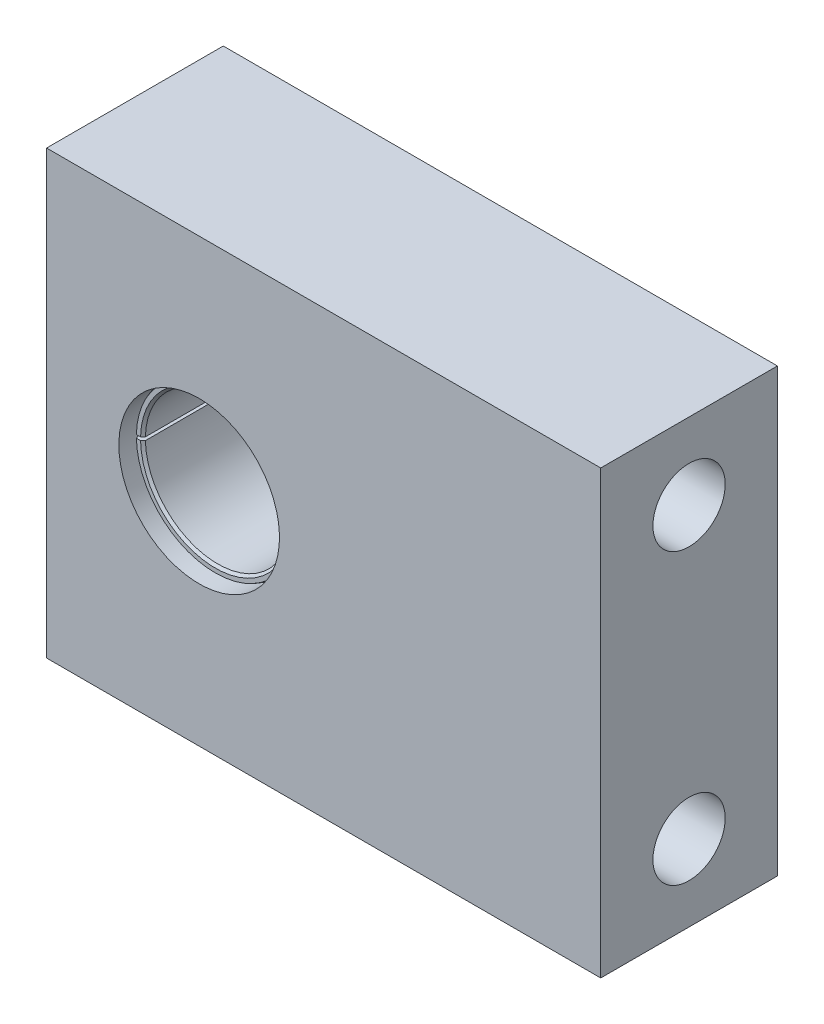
ISO-10303-21;
HEADER;
FILE_DESCRIPTION(('STEP AP214'),'2;1');
FILE_NAME('part.step','',(''),(''),'','','');
FILE_SCHEMA(('AUTOMOTIVE_DESIGN { 1 0 10303 214 1 1 1 1 }'));
ENDSEC;
DATA;
#1=APPLICATION_CONTEXT('core data for automotive mechanical design processes');
#2=APPLICATION_PROTOCOL_DEFINITION('international standard','automotive_design',2000,#1);
#3=PRODUCT_CONTEXT('',#1,'mechanical');
#4=PRODUCT('Part','Part','',(#3));
#5=PRODUCT_RELATED_PRODUCT_CATEGORY('part','',(#4));
#6=PRODUCT_DEFINITION_FORMATION('','',#4);
#7=PRODUCT_DEFINITION_CONTEXT('part definition',#1,'design');
#8=PRODUCT_DEFINITION('design','',#6,#7);
#9=PRODUCT_DEFINITION_SHAPE('','',#8);
#10=(LENGTH_UNIT() NAMED_UNIT(*) SI_UNIT(.MILLI.,.METRE.));
#11=(NAMED_UNIT(*) PLANE_ANGLE_UNIT() SI_UNIT($,.RADIAN.));
#12=(NAMED_UNIT(*) SI_UNIT($,.STERADIAN.) SOLID_ANGLE_UNIT());
#13=UNCERTAINTY_MEASURE_WITH_UNIT(LENGTH_MEASURE(1.E-05),#10,'distance_accuracy_value','');
#14=(GEOMETRIC_REPRESENTATION_CONTEXT(3) GLOBAL_UNCERTAINTY_ASSIGNED_CONTEXT((#13)) GLOBAL_UNIT_ASSIGNED_CONTEXT((#10,
#11,#12)) REPRESENTATION_CONTEXT('',''));
#15=CARTESIAN_POINT('',(0.,0.,0.));
#16=DIRECTION('',(0.,0.,1.));
#17=DIRECTION('',(1.,0.,0.));
#18=AXIS2_PLACEMENT_3D('',#15,#16,#17);
#19=CARTESIAN_POINT('',(-60.346410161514,18.2,9.));
#20=DIRECTION('',(0.,1.,0.));
#21=DIRECTION('',(0.,0.,-1.));
#22=AXIS2_PLACEMENT_3D('',#19,#20,#21);
#23=PLANE('',#22);
#24=DIRECTION('',(1.,0.,0.));
#25=VECTOR('',#24,1.);
#26=CARTESIAN_POINT('',(-60.346410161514,18.2,-11.));
#27=LINE('',#26,#25);
#28=CARTESIAN_POINT('',(-60.346410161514,18.2,-11.));
#29=VERTEX_POINT('',#28);
#30=CARTESIAN_POINT('',(-59.99799979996,18.2,-11.));
#31=VERTEX_POINT('',#30);
#32=EDGE_CURVE('E9',#29,#31,#27,.T.);
#33=ORIENTED_EDGE('',*,*,#32,.F.);
#34=DIRECTION('',(0.,0.,-1.));
#35=VECTOR('',#34,1.);
#36=CARTESIAN_POINT('',(-60.346410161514,18.2,9.));
#37=LINE('',#36,#35);
#38=CARTESIAN_POINT('',(-60.346410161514,18.2,-12.));
#39=VERTEX_POINT('',#38);
#40=EDGE_CURVE('E140',#29,#39,#37,.T.);
#41=ORIENTED_EDGE('',*,*,#40,.T.);
#42=DIRECTION('',(1.,0.,0.));
#43=VECTOR('',#42,1.);
#44=CARTESIAN_POINT('',(-60.346410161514,18.2,-12.));
#45=LINE('',#44,#43);
#46=CARTESIAN_POINT('',(-59.4978945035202,18.2,-12.));
#47=VERTEX_POINT('',#46);
#48=EDGE_CURVE('E345',#39,#47,#45,.T.);
#49=ORIENTED_EDGE('',*,*,#48,.T.);
#50=CARTESIAN_POINT('',(-59.4978945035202,18.1999999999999,-12.));
#51=CARTESIAN_POINT('',(-59.4447247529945,18.1999999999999,-12.));
#52=CARTESIAN_POINT('',(-59.3908863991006,18.1999999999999,-11.9913046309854));
#53=CARTESIAN_POINT('',(-59.2872805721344,18.1999999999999,-11.9569409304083));
#54=CARTESIAN_POINT('',(-59.2364510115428,18.1999999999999,-11.9298976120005));
#55=CARTESIAN_POINT('',(-59.1643973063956,18.1999999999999,-11.8742450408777));
#56=CARTESIAN_POINT('',(-59.1387783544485,18.1999999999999,-11.8497481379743));
#57=CARTESIAN_POINT('',(-59.0799770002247,18.1999999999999,-11.7802791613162));
#58=CARTESIAN_POINT('',(-59.0506993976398,18.1999999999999,-11.7307389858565));
#59=CARTESIAN_POINT('',(-59.0107444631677,18.1999999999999,-11.6262008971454));
#60=CARTESIAN_POINT('',(-58.9995164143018,18.1999999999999,-11.5697612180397));
#61=CARTESIAN_POINT('',(-58.9978427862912,18.1999999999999,-11.5092736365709));
#62=CARTESIAN_POINT('',(-58.9977775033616,18.1999999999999,-11.5045538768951));
#63=CARTESIAN_POINT('',(-58.9977775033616,18.1999999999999,-11.5));
#64=B_SPLINE_CURVE_WITH_KNOTS('',3,(#50,#51,#52,#53,#54,#55,#56,#57,#58,#59,#60,#61,#62,#63),
.UNSPECIFIED.,.F.,.F.,(4,2,2,2,2,2,4),(0.,0.203965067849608,0.418734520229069,0.55321859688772,
0.767874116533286,0.9825308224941,1.),.UNSPECIFIED.);
#65=CARTESIAN_POINT('',(-58.9977775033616,18.2,-11.5));
#66=VERTEX_POINT('',#65);
#67=EDGE_CURVE('E369',#47,#66,#64,.T.);
#68=ORIENTED_EDGE('',*,*,#67,.T.);
#69=DIRECTION('',(0.,0.,1.));
#70=VECTOR('',#69,1.);
#71=CARTESIAN_POINT('',(-58.9977775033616,18.2,9.));
#72=LINE('',#71,#70);
#73=CARTESIAN_POINT('',(-58.9977775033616,18.2,8.7));
#74=VERTEX_POINT('',#73);
#75=EDGE_CURVE('E219',#66,#74,#72,.T.);
#76=ORIENTED_EDGE('',*,*,#75,.T.);
#77=CARTESIAN_POINT('',(-58.9977775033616,18.2,8.7));
#78=CARTESIAN_POINT('',(-59.0978018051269,18.2,8.79999960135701));
#79=CARTESIAN_POINT('',(-59.1978256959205,18.2,8.89999961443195));
#80=CARTESIAN_POINT('',(-59.2978492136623,18.2,9.));
#81=B_SPLINE_CURVE_WITH_KNOTS('',3,(#77,#78,#79,#80),.UNSPECIFIED.,.F.,.F.,(4,4),(0.,1.),.UNSPECIFIED.);
#82=CARTESIAN_POINT('',(-59.2978492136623,18.2,9.));
#83=VERTEX_POINT('',#82);
#84=EDGE_CURVE('E205',#74,#83,#81,.T.);
#85=ORIENTED_EDGE('',*,*,#84,.T.);
#86=DIRECTION('',(1.,0.,0.));
#87=VECTOR('',#86,1.);
#88=CARTESIAN_POINT('',(-60.346410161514,18.2,9.));
#89=LINE('',#88,#87);
#90=CARTESIAN_POINT('',(-59.8159775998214,18.2,9.));
#91=VERTEX_POINT('',#90);
#92=EDGE_CURVE('E206',#91,#83,#89,.T.);
#93=ORIENTED_EDGE('',*,*,#92,.F.);
#94=CARTESIAN_POINT('',(-59.8159775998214,18.2,9.));
#95=CARTESIAN_POINT('',(-59.8766518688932,18.2,8.83333340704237));
#96=CARTESIAN_POINT('',(-59.9373259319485,18.2,8.6666667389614));
#97=CARTESIAN_POINT('',(-59.99799979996,18.2,8.5));
#98=B_SPLINE_CURVE_WITH_KNOTS('',3,(#94,#95,#96,#97),.UNSPECIFIED.,.F.,.F.,(4,4),(0.,1.),.UNSPECIFIED.);
#99=CARTESIAN_POINT('',(-59.99799979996,18.2,8.5));
#100=VERTEX_POINT('',#99);
#101=EDGE_CURVE('E266',#91,#100,#98,.T.);
#102=ORIENTED_EDGE('',*,*,#101,.T.);
#103=DIRECTION('',(0.,0.,-1.));
#104=VECTOR('',#103,1.);
#105=CARTESIAN_POINT('',(-59.99799979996,18.2,9.));
#106=LINE('',#105,#104);
#107=EDGE_CURVE('E31',#100,#31,#106,.T.);
#108=ORIENTED_EDGE('',*,*,#107,.T.);
#109=EDGE_LOOP('',(#33,#41,#49,#68,#76,#85,#93,#102,#108));
#110=FACE_BOUND('',#109,.T.);
#111=ADVANCED_FACE('F14',(#110),#23,.F.);
#112=CARTESIAN_POINT('',(-50.,18.,-11.5));
#113=DIRECTION('',(0.,0.,1.));
#114=DIRECTION('',(-1.,0.,0.));
#115=AXIS2_PLACEMENT_3D('',#112,#113,#114);
#116=TOROIDAL_SURFACE('',#115,9.5,0.499999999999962);
#117=CARTESIAN_POINT('',(-58.9977775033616,17.7999999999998,-11.5));
#118=CARTESIAN_POINT('',(-58.9977775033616,17.7999999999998,-11.5256439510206));
#119=CARTESIAN_POINT('',(-58.999795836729,17.7999999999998,-11.5516852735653));
#120=CARTESIAN_POINT('',(-59.0123678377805,17.7999999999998,-11.632303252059));
#121=CARTESIAN_POINT('',(-59.03065153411,17.7999999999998,-11.6868572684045));
#122=CARTESIAN_POINT('',(-59.07361744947,17.7999999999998,-11.7670154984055));
#123=CARTESIAN_POINT('',(-59.0935171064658,17.7999999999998,-11.7962756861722));
#124=CARTESIAN_POINT('',(-59.1522928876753,17.7999999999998,-11.8657144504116));
#125=CARTESIAN_POINT('',(-59.1963333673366,17.7999999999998,-11.9027836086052));
#126=CARTESIAN_POINT('',(-59.2928693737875,17.7999999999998,-11.959473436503));
#127=CARTESIAN_POINT('',(-59.3466959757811,17.7999999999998,-11.979876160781));
#128=CARTESIAN_POINT('',(-59.433181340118,17.7999999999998,-11.9968377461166));
#129=CARTESIAN_POINT('',(-59.4657367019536,17.7999999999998,-12.));
#130=CARTESIAN_POINT('',(-59.4978945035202,17.7999999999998,-12.));
#131=B_SPLINE_CURVE_WITH_KNOTS('',3,(#117,#118,#119,#120,#121,#122,#123,#124,#125,#126,#127,
#128,#129,#130),.UNSPECIFIED.,.F.,.F.,(4,2,2,2,2,2,4),(0.,0.0983658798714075,0.312974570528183,
0.447224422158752,0.661936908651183,0.87664808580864,1.),.UNSPECIFIED.);
#132=CARTESIAN_POINT('',(-58.9977775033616,17.8,-11.5));
#133=VERTEX_POINT('',#132);
#134=CARTESIAN_POINT('',(-59.4978945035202,17.8,-12.));
#135=VERTEX_POINT('',#134);
#136=EDGE_CURVE('E375',#133,#135,#131,.T.);
#137=ORIENTED_EDGE('',*,*,#136,.F.);
#138=CARTESIAN_POINT('',(-50.,18.,-11.5));
#139=DIRECTION('',(0.,0.,1.));
#140=DIRECTION('',(0.,1.,0.));
#141=AXIS2_PLACEMENT_3D('',#138,#139,#140);
#142=CIRCLE('',#141,9.);
#143=EDGE_CURVE('E373',#133,#66,#142,.T.);
#144=ORIENTED_EDGE('',*,*,#143,.T.);
#145=ORIENTED_EDGE('',*,*,#67,.F.);
#146=CARTESIAN_POINT('',(-50.,18.,-12.));
#147=DIRECTION('',(0.,0.,1.));
#148=DIRECTION('',(0.,1.,0.));
#149=AXIS2_PLACEMENT_3D('',#146,#147,#148);
#150=CIRCLE('',#149,9.5);
#151=EDGE_CURVE('E131',#135,#47,#150,.T.);
#152=ORIENTED_EDGE('',*,*,#151,.F.);
#153=EDGE_LOOP('',(#137,#144,#145,#152));
#154=FACE_BOUND('',#153,.T.);
#155=ADVANCED_FACE('F371',(#154),#116,.T.);
#156=CARTESIAN_POINT('',(-50.,18.,9.));
#157=DIRECTION('',(0.,0.,1.));
#158=DIRECTION('',(-1.,0.,0.));
#159=AXIS2_PLACEMENT_3D('',#156,#157,#158);
#160=CYLINDRICAL_SURFACE('',#159,9.);
#161=DIRECTION('',(0.,0.,-1.));
#162=VECTOR('',#161,1.);
#163=CARTESIAN_POINT('',(-58.9977775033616,17.8,9.));
#164=LINE('',#163,#162);
#165=CARTESIAN_POINT('',(-58.9977775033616,17.8,8.7));
#166=VERTEX_POINT('',#165);
#167=EDGE_CURVE('E193',#166,#133,#164,.T.);
#168=ORIENTED_EDGE('',*,*,#167,.F.);
#169=CARTESIAN_POINT('',(-50.,18.,8.7));
#170=DIRECTION('',(0.,0.,1.));
#171=DIRECTION('',(0.,1.,0.));
#172=AXIS2_PLACEMENT_3D('',#169,#170,#171);
#173=CIRCLE('',#172,9.);
#174=EDGE_CURVE('E209',#166,#74,#173,.T.);
#175=ORIENTED_EDGE('',*,*,#174,.T.);
#176=ORIENTED_EDGE('',*,*,#75,.F.);
#177=ORIENTED_EDGE('',*,*,#143,.F.);
#178=EDGE_LOOP('',(#168,#175,#176,#177));
#179=FACE_BOUND('',#178,.T.);
#180=ADVANCED_FACE('F242',(#179),#160,.F.);
#181=CARTESIAN_POINT('',(-50.,18.,8.7));
#182=DIRECTION('',(0.,0.,1.));
#183=DIRECTION('',(-1.,0.,0.));
#184=AXIS2_PLACEMENT_3D('',#181,#182,#183);
#185=CONICAL_SURFACE('',#184,9.,0.785398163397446);
#186=CARTESIAN_POINT('',(-59.2978492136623,17.8,9.));
#187=CARTESIAN_POINT('',(-59.1978256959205,17.8,8.89999961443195));
#188=CARTESIAN_POINT('',(-59.0978018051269,17.8,8.79999960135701));
#189=CARTESIAN_POINT('',(-58.9977775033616,17.8,8.7));
#190=B_SPLINE_CURVE_WITH_KNOTS('',3,(#186,#187,#188,#189),.UNSPECIFIED.,.F.,.F.,(4,4),(0.,1.),.UNSPECIFIED.);
#191=CARTESIAN_POINT('',(-59.2978492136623,17.8,9.));
#192=VERTEX_POINT('',#191);
#193=EDGE_CURVE('E184',#192,#166,#190,.T.);
#194=ORIENTED_EDGE('',*,*,#193,.F.);
#195=CARTESIAN_POINT('',(-50.,18.,9.));
#196=DIRECTION('',(0.,0.,1.));
#197=DIRECTION('',(0.,1.,0.));
#198=AXIS2_PLACEMENT_3D('',#195,#196,#197);
#199=CIRCLE('',#198,9.3);
#200=EDGE_CURVE('E204',#192,#83,#199,.T.);
#201=ORIENTED_EDGE('',*,*,#200,.T.);
#202=ORIENTED_EDGE('',*,*,#84,.F.);
#203=ORIENTED_EDGE('',*,*,#174,.F.);
#204=EDGE_LOOP('',(#194,#201,#202,#203));
#205=FACE_BOUND('',#204,.T.);
#206=ADVANCED_FACE('F231',(#205),#185,.F.);
#207=CARTESIAN_POINT('',(-59.3,18.,9.));
#208=DIRECTION('',(0.,0.,1.));
#209=DIRECTION('',(0.,1.,0.));
#210=AXIS2_PLACEMENT_3D('',#207,#208,#209);
#211=PLANE('',#210);
#212=DIRECTION('',(-1.,0.,0.));
#213=VECTOR('',#212,1.);
#214=CARTESIAN_POINT('',(-50.,17.8,9.));
#215=LINE('',#214,#213);
#216=CARTESIAN_POINT('',(-59.8159775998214,17.8,9.));
#217=VERTEX_POINT('',#216);
#218=EDGE_CURVE('E196',#192,#217,#215,.T.);
#219=ORIENTED_EDGE('',*,*,#218,.T.);
#220=CARTESIAN_POINT('',(-50.,18.,9.));
#221=DIRECTION('',(0.,0.,1.));
#222=DIRECTION('',(0.,1.,0.));
#223=AXIS2_PLACEMENT_3D('',#220,#221,#222);
#224=CIRCLE('',#223,9.8180148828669);
#225=EDGE_CURVE('E261',#217,#91,#224,.T.);
#226=ORIENTED_EDGE('',*,*,#225,.T.);
#227=ORIENTED_EDGE('',*,*,#92,.T.);
#228=ORIENTED_EDGE('',*,*,#200,.F.);
#229=EDGE_LOOP('',(#219,#226,#227,#228));
#230=FACE_BOUND('',#229,.T.);
#231=ADVANCED_FACE('F241',(#230),#211,.T.);
#232=CARTESIAN_POINT('',(-50.,18.,9.));
#233=DIRECTION('',(0.,0.,-1.));
#234=DIRECTION('',(-1.,0.,0.));
#235=AXIS2_PLACEMENT_3D('',#232,#233,#234);
#236=CONICAL_SURFACE('',#235,9.8180148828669,0.349065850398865);
#237=CARTESIAN_POINT('',(-59.99799979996,17.8,8.5));
#238=CARTESIAN_POINT('',(-59.9373259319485,17.8,8.6666667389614));
#239=CARTESIAN_POINT('',(-59.8766518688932,17.8,8.83333340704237));
#240=CARTESIAN_POINT('',(-59.8159775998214,17.8,9.));
#241=B_SPLINE_CURVE_WITH_KNOTS('',3,(#237,#238,#239,#240),.UNSPECIFIED.,.F.,.F.,(4,4),(0.,1.),.UNSPECIFIED.);
#242=CARTESIAN_POINT('',(-59.99799979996,17.8,8.5));
#243=VERTEX_POINT('',#242);
#244=EDGE_CURVE('E300',#243,#217,#241,.T.);
#245=ORIENTED_EDGE('',*,*,#244,.F.);
#246=CARTESIAN_POINT('',(-50.,18.,8.5));
#247=DIRECTION('',(0.,0.,1.));
#248=DIRECTION('',(0.,1.,0.));
#249=AXIS2_PLACEMENT_3D('',#246,#247,#248);
#250=CIRCLE('',#249,10.);
#251=EDGE_CURVE('E301',#243,#100,#250,.T.);
#252=ORIENTED_EDGE('',*,*,#251,.T.);
#253=ORIENTED_EDGE('',*,*,#101,.F.);
#254=ORIENTED_EDGE('',*,*,#225,.F.);
#255=EDGE_LOOP('',(#245,#252,#253,#254));
#256=FACE_BOUND('',#255,.T.);
#257=ADVANCED_FACE('F274',(#256),#236,.T.);
#258=CARTESIAN_POINT('',(-50.,18.,9.));
#259=DIRECTION('',(0.,0.,1.));
#260=DIRECTION('',(-1.,0.,0.));
#261=AXIS2_PLACEMENT_3D('',#258,#259,#260);
#262=CYLINDRICAL_SURFACE('',#261,13.);
#263=DIRECTION('',(0.,0.,1.));
#264=VECTOR('',#263,1.);
#265=CARTESIAN_POINT('',(-62.8923048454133,16.3301270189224,9.));
#266=LINE('',#265,#264);
#267=CARTESIAN_POINT('',(-62.8923048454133,16.3301270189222,-12.));
#268=VERTEX_POINT('',#267);
#269=CARTESIAN_POINT('',(-62.8923048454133,16.3301270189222,-11.));
#270=VERTEX_POINT('',#269);
#271=EDGE_CURVE('E331',#268,#270,#266,.T.);
#272=ORIENTED_EDGE('',*,*,#271,.F.);
#273=CARTESIAN_POINT('',(-50.,18.,-12.));
#274=DIRECTION('',(0.,0.,1.));
#275=DIRECTION('',(0.,1.,0.));
#276=AXIS2_PLACEMENT_3D('',#273,#274,#275);
#277=CIRCLE('',#276,13.);
#278=CARTESIAN_POINT('',(-62.8923048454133,19.6698729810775,-12.));
#279=VERTEX_POINT('',#278);
#280=EDGE_CURVE('E335',#268,#279,#277,.T.);
#281=ORIENTED_EDGE('',*,*,#280,.T.);
#282=DIRECTION('',(0.,0.,-1.));
#283=VECTOR('',#282,1.);
#284=CARTESIAN_POINT('',(-62.8923048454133,19.6698729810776,9.));
#285=LINE('',#284,#283);
#286=CARTESIAN_POINT('',(-62.8923048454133,19.6698729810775,-11.));
#287=VERTEX_POINT('',#286);
#288=EDGE_CURVE('E326',#287,#279,#285,.T.);
#289=ORIENTED_EDGE('',*,*,#288,.F.);
#290=CARTESIAN_POINT('',(-50.,18.,-11.));
#291=DIRECTION('',(0.,0.,1.));
#292=DIRECTION('',(0.,1.,0.));
#293=AXIS2_PLACEMENT_3D('',#290,#291,#292);
#294=CIRCLE('',#293,13.);
#295=EDGE_CURVE('E321',#270,#287,#294,.T.);
#296=ORIENTED_EDGE('',*,*,#295,.F.);
#297=EDGE_LOOP('',(#272,#281,#289,#296));
#298=FACE_BOUND('',#297,.T.);
#299=ADVANCED_FACE('F283',(#298),#262,.T.);
#300=CARTESIAN_POINT('',(-63.,18.,-12.));
#301=DIRECTION('',(0.,0.,-1.));
#302=DIRECTION('',(0.,-1.,0.));
#303=AXIS2_PLACEMENT_3D('',#300,#301,#302);
#304=PLANE('',#303);
#305=DIRECTION('',(-0.866025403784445,-0.499999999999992,0.));
#306=VECTOR('',#305,1.);
#307=CARTESIAN_POINT('',(-60.346410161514,17.8,-12.));
#308=LINE('',#307,#306);
#309=CARTESIAN_POINT('',(-60.346410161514,17.8,-12.));
#310=VERTEX_POINT('',#309);
#311=EDGE_CURVE('E115',#310,#268,#308,.T.);
#312=ORIENTED_EDGE('',*,*,#311,.F.);
#313=DIRECTION('',(-1.,0.,0.));
#314=VECTOR('',#313,1.);
#315=CARTESIAN_POINT('',(-50.,17.8,-12.));
#316=LINE('',#315,#314);
#317=EDGE_CURVE('E123',#135,#310,#316,.T.);
#318=ORIENTED_EDGE('',*,*,#317,.F.);
#319=ORIENTED_EDGE('',*,*,#151,.T.);
#320=ORIENTED_EDGE('',*,*,#48,.F.);
#321=DIRECTION('',(0.866025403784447,-0.499999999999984,0.));
#322=VECTOR('',#321,1.);
#323=CARTESIAN_POINT('',(-63.359903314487,19.9398410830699,-12.));
#324=LINE('',#323,#322);
#325=EDGE_CURVE('E340',#279,#39,#324,.T.);
#326=ORIENTED_EDGE('',*,*,#325,.F.);
#327=ORIENTED_EDGE('',*,*,#280,.F.);
#328=EDGE_LOOP('',(#312,#318,#319,#320,#326,#327));
#329=FACE_BOUND('',#328,.T.);
#330=ADVANCED_FACE('F164',(#329),#304,.T.);
#331=CARTESIAN_POINT('',(-50.,17.8,9.));
#332=DIRECTION('',(0.,-1.,0.));
#333=DIRECTION('',(0.,0.,1.));
#334=AXIS2_PLACEMENT_3D('',#331,#332,#333);
#335=PLANE('',#334);
#336=DIRECTION('',(-1.,0.,0.));
#337=VECTOR('',#336,1.);
#338=CARTESIAN_POINT('',(-50.,17.8,-11.));
#339=LINE('',#338,#337);
#340=CARTESIAN_POINT('',(-59.99799979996,17.8,-11.));
#341=VERTEX_POINT('',#340);
#342=CARTESIAN_POINT('',(-60.346410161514,17.8,-11.));
#343=VERTEX_POINT('',#342);
#344=EDGE_CURVE('E23',#341,#343,#339,.T.);
#345=ORIENTED_EDGE('',*,*,#344,.F.);
#346=DIRECTION('',(0.,0.,1.));
#347=VECTOR('',#346,1.);
#348=CARTESIAN_POINT('',(-59.99799979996,17.8,9.));
#349=LINE('',#348,#347);
#350=EDGE_CURVE('E306',#341,#243,#349,.T.);
#351=ORIENTED_EDGE('',*,*,#350,.T.);
#352=ORIENTED_EDGE('',*,*,#244,.T.);
#353=ORIENTED_EDGE('',*,*,#218,.F.);
#354=ORIENTED_EDGE('',*,*,#193,.T.);
#355=ORIENTED_EDGE('',*,*,#167,.T.);
#356=ORIENTED_EDGE('',*,*,#136,.T.);
#357=ORIENTED_EDGE('',*,*,#317,.T.);
#358=DIRECTION('',(0.,0.,-1.));
#359=VECTOR('',#358,1.);
#360=CARTESIAN_POINT('',(-60.346410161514,17.8,9.));
#361=LINE('',#360,#359);
#362=EDGE_CURVE('E104',#343,#310,#361,.T.);
#363=ORIENTED_EDGE('',*,*,#362,.F.);
#364=EDGE_LOOP('',(#345,#351,#352,#353,#354,#355,#356,#357,#363));
#365=FACE_BOUND('',#364,.T.);
#366=ADVANCED_FACE('F153',(#365),#335,.F.);
#367=CARTESIAN_POINT('',(-60.346410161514,17.8,9.));
#368=DIRECTION('',(0.49999999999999,-0.866025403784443,0.));
#369=DIRECTION('',(0.866025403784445,0.499999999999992,0.));
#370=AXIS2_PLACEMENT_3D('',#367,#368,#369);
#371=PLANE('',#370);
#372=DIRECTION('',(0.866025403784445,0.499999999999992,0.));
#373=VECTOR('',#372,1.);
#374=CARTESIAN_POINT('',(-60.375,17.7834936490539,-11.));
#375=LINE('',#374,#373);
#376=EDGE_CURVE('E316',#270,#343,#375,.T.);
#377=ORIENTED_EDGE('',*,*,#376,.T.);
#378=ORIENTED_EDGE('',*,*,#362,.T.);
#379=ORIENTED_EDGE('',*,*,#311,.T.);
#380=ORIENTED_EDGE('',*,*,#271,.T.);
#381=EDGE_LOOP('',(#377,#378,#379,#380));
#382=FACE_BOUND('',#381,.T.);
#383=ADVANCED_FACE('F163',(#382),#371,.F.);
#384=CARTESIAN_POINT('',(-63.359903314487,19.93984108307,9.));
#385=DIRECTION('',(0.499999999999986,0.866025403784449,0.));
#386=DIRECTION('',(-0.866025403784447,0.499999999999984,0.));
#387=AXIS2_PLACEMENT_3D('',#384,#385,#386);
#388=PLANE('',#387);
#389=ORIENTED_EDGE('',*,*,#40,.F.);
#390=DIRECTION('',(-0.866025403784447,0.499999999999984,0.));
#391=VECTOR('',#390,1.);
#392=CARTESIAN_POINT('',(-60.375,18.2165063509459,-11.));
#393=LINE('',#392,#391);
#394=EDGE_CURVE('E311',#29,#287,#393,.T.);
#395=ORIENTED_EDGE('',*,*,#394,.T.);
#396=ORIENTED_EDGE('',*,*,#288,.T.);
#397=ORIENTED_EDGE('',*,*,#325,.T.);
#398=EDGE_LOOP('',(#389,#395,#396,#397));
#399=FACE_BOUND('',#398,.T.);
#400=ADVANCED_FACE('F166',(#399),#388,.F.);
#401=CARTESIAN_POINT('',(-57.,36.,-1.30102056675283E-13));
#402=DIRECTION('',(-1.,0.,0.));
#403=DIRECTION('',(0.,0.,1.));
#404=AXIS2_PLACEMENT_3D('',#401,#402,#403);
#405=PLANE('',#404);
#406=CARTESIAN_POINT('',(-57.,36.,-1.30102056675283E-13));
#407=DIRECTION('',(-1.,0.,0.));
#408=DIRECTION('',(0.,0.,1.));
#409=AXIS2_PLACEMENT_3D('',#406,#407,#408);
#410=CIRCLE('',#409,4.5);
#411=CARTESIAN_POINT('',(-57.,36.,4.49999999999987));
#412=VERTEX_POINT('',#411);
#413=EDGE_CURVE('E105',#412,#412,#410,.T.);
#414=ORIENTED_EDGE('',*,*,#413,.F.);
#415=EDGE_LOOP('',(#414));
#416=FACE_BOUND('',#415,.T.);
#417=CARTESIAN_POINT('',(-57.,36.,-1.30102056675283E-13));
#418=DIRECTION('',(-1.,0.,0.));
#419=DIRECTION('',(0.,0.,1.));
#420=AXIS2_PLACEMENT_3D('',#417,#418,#419);
#421=CIRCLE('',#420,7.);
#422=CARTESIAN_POINT('',(-57.,36.,6.99999999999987));
#423=VERTEX_POINT('',#422);
#424=EDGE_CURVE('E109',#423,#423,#421,.T.);
#425=ORIENTED_EDGE('',*,*,#424,.T.);
#426=EDGE_LOOP('',(#425));
#427=FACE_BOUND('',#426,.T.);
#428=ADVANCED_FACE('F476',(#416,#427),#405,.T.);
#429=CARTESIAN_POINT('',(-57.,0.,1.25693328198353E-13));
#430=DIRECTION('',(-1.,0.,0.));
#431=DIRECTION('',(0.,0.,1.));
#432=AXIS2_PLACEMENT_3D('',#429,#430,#431);
#433=PLANE('',#432);
#434=CARTESIAN_POINT('',(-57.,0.,1.25693328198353E-13));
#435=DIRECTION('',(-1.,0.,0.));
#436=DIRECTION('',(0.,0.,1.));
#437=AXIS2_PLACEMENT_3D('',#434,#435,#436);
#438=CIRCLE('',#437,4.5);
#439=CARTESIAN_POINT('',(-57.,0.,4.50000000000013));
#440=VERTEX_POINT('',#439);
#441=EDGE_CURVE('E110',#440,#440,#438,.T.);
#442=ORIENTED_EDGE('',*,*,#441,.F.);
#443=EDGE_LOOP('',(#442));
#444=FACE_BOUND('',#443,.T.);
#445=CARTESIAN_POINT('',(-57.,0.,1.25693328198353E-13));
#446=DIRECTION('',(-1.,0.,0.));
#447=DIRECTION('',(0.,0.,1.));
#448=AXIS2_PLACEMENT_3D('',#445,#446,#447);
#449=CIRCLE('',#448,7.);
#450=CARTESIAN_POINT('',(-57.,0.,7.00000000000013));
#451=VERTEX_POINT('',#450);
#452=EDGE_CURVE('E113',#451,#451,#449,.T.);
#453=ORIENTED_EDGE('',*,*,#452,.T.);
#454=EDGE_LOOP('',(#453));
#455=FACE_BOUND('',#454,.T.);
#456=ADVANCED_FACE('F480',(#444,#455),#433,.T.);
#457=CARTESIAN_POINT('',(-57.,36.,-1.30102056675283E-13));
#458=DIRECTION('',(-1.,0.,0.));
#459=DIRECTION('',(0.,0.,1.));
#460=AXIS2_PLACEMENT_3D('',#457,#458,#459);
#461=CYLINDRICAL_SURFACE('',#460,7.);
#462=ORIENTED_EDGE('',*,*,#424,.F.);
#463=EDGE_LOOP('',(#462));
#464=FACE_BOUND('',#463,.T.);
#465=CARTESIAN_POINT('',(-69.,36.,-1.30102056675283E-13));
#466=DIRECTION('',(-1.,0.,0.));
#467=DIRECTION('',(0.,0.,1.));
#468=AXIS2_PLACEMENT_3D('',#465,#466,#467);
#469=CIRCLE('',#468,7.);
#470=CARTESIAN_POINT('',(-69.,36.,6.99999999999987));
#471=VERTEX_POINT('',#470);
#472=EDGE_CURVE('E112',#471,#471,#469,.T.);
#473=ORIENTED_EDGE('',*,*,#472,.T.);
#474=EDGE_LOOP('',(#473));
#475=FACE_BOUND('',#474,.T.);
#476=ADVANCED_FACE('F486',(#464,#475),#461,.F.);
#477=CARTESIAN_POINT('',(-57.,0.,1.25693328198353E-13));
#478=DIRECTION('',(-1.,0.,0.));
#479=DIRECTION('',(0.,0.,1.));
#480=AXIS2_PLACEMENT_3D('',#477,#478,#479);
#481=CYLINDRICAL_SURFACE('',#480,7.);
#482=ORIENTED_EDGE('',*,*,#452,.F.);
#483=EDGE_LOOP('',(#482));
#484=FACE_BOUND('',#483,.T.);
#485=CARTESIAN_POINT('',(-69.,0.,1.25693328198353E-13));
#486=DIRECTION('',(-1.,0.,0.));
#487=DIRECTION('',(0.,0.,1.));
#488=AXIS2_PLACEMENT_3D('',#485,#486,#487);
#489=CIRCLE('',#488,7.);
#490=CARTESIAN_POINT('',(-69.,0.,7.00000000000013));
#491=VERTEX_POINT('',#490);
#492=EDGE_CURVE('E683',#491,#491,#489,.T.);
#493=ORIENTED_EDGE('',*,*,#492,.T.);
#494=EDGE_LOOP('',(#493));
#495=FACE_BOUND('',#494,.T.);
#496=ADVANCED_FACE('F493',(#484,#495),#481,.F.);
#497=CARTESIAN_POINT('',(-69.,36.,-1.30102056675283E-13));
#498=DIRECTION('',(1.,0.,0.));
#499=DIRECTION('',(0.,0.,-1.));
#500=AXIS2_PLACEMENT_3D('',#497,#498,#499);
#501=CYLINDRICAL_SURFACE('',#500,4.5);
#502=CARTESIAN_POINT('',(0.,36.,-1.30102056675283E-13));
#503=DIRECTION('',(-1.,0.,0.));
#504=DIRECTION('',(0.,0.,1.));
#505=AXIS2_PLACEMENT_3D('',#502,#503,#504);
#506=CIRCLE('',#505,4.5);
#507=CARTESIAN_POINT('',(0.,36.,4.49999999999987));
#508=VERTEX_POINT('',#507);
#509=EDGE_CURVE('E93',#508,#508,#506,.T.);
#510=ORIENTED_EDGE('',*,*,#509,.F.);
#511=EDGE_LOOP('',(#510));
#512=FACE_BOUND('',#511,.T.);
#513=ORIENTED_EDGE('',*,*,#413,.T.);
#514=EDGE_LOOP('',(#513));
#515=FACE_BOUND('',#514,.T.);
#516=ADVANCED_FACE('F500',(#512,#515),#501,.F.);
#517=CARTESIAN_POINT('',(-69.,0.,1.25693328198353E-13));
#518=DIRECTION('',(1.,0.,0.));
#519=DIRECTION('',(0.,0.,-1.));
#520=AXIS2_PLACEMENT_3D('',#517,#518,#519);
#521=CYLINDRICAL_SURFACE('',#520,4.5);
#522=CARTESIAN_POINT('',(0.,1.94289029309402E-13,1.25693328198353E-13));
#523=DIRECTION('',(-1.,0.,0.));
#524=DIRECTION('',(0.,0.,1.));
#525=AXIS2_PLACEMENT_3D('',#522,#523,#524);
#526=CIRCLE('',#525,4.5);
#527=CARTESIAN_POINT('',(0.,2.25712361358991E-13,4.50000000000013));
#528=VERTEX_POINT('',#527);
#529=EDGE_CURVE('E89',#528,#528,#526,.T.);
#530=ORIENTED_EDGE('',*,*,#529,.F.);
#531=EDGE_LOOP('',(#530));
#532=FACE_BOUND('',#531,.T.);
#533=ORIENTED_EDGE('',*,*,#441,.T.);
#534=EDGE_LOOP('',(#533));
#535=FACE_BOUND('',#534,.T.);
#536=ADVANCED_FACE('F503',(#532,#535),#521,.F.);
#537=CARTESIAN_POINT('',(-69.,-9.5,11.0000000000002));
#538=DIRECTION('',(0.,0.,-1.));
#539=DIRECTION('',(0.,-1.,0.));
#540=AXIS2_PLACEMENT_3D('',#537,#538,#539);
#541=PLANE('',#540);
#542=CARTESIAN_POINT('',(-50.,18.,11.));
#543=DIRECTION('',(0.,0.,1.));
#544=DIRECTION('',(0.,1.,0.));
#545=AXIS2_PLACEMENT_3D('',#542,#543,#544);
#546=CIRCLE('',#545,10.);
#547=CARTESIAN_POINT('',(-50.,28.,10.9999999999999));
#548=VERTEX_POINT('',#547);
#549=EDGE_CURVE('E108',#548,#548,#546,.T.);
#550=ORIENTED_EDGE('',*,*,#549,.F.);
#551=EDGE_LOOP('',(#550));
#552=FACE_BOUND('',#551,.T.);
#553=DIRECTION('',(0.,1.,0.));
#554=VECTOR('',#553,1.);
#555=CARTESIAN_POINT('',(0.,-9.49999999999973,11.0000000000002));
#556=LINE('',#555,#554);
#557=CARTESIAN_POINT('',(0.,-9.49999999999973,11.0000000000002));
#558=VERTEX_POINT('',#557);
#559=CARTESIAN_POINT('',(0.,45.5,10.9999999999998));
#560=VERTEX_POINT('',#559);
#561=EDGE_CURVE('E67',#558,#560,#556,.T.);
#562=ORIENTED_EDGE('',*,*,#561,.T.);
#563=DIRECTION('',(1.,0.,0.));
#564=VECTOR('',#563,1.);
#565=CARTESIAN_POINT('',(-69.,45.5,10.9999999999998));
#566=LINE('',#565,#564);
#567=CARTESIAN_POINT('',(-69.,45.5,10.9999999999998));
#568=VERTEX_POINT('',#567);
#569=EDGE_CURVE('E71',#568,#560,#566,.T.);
#570=ORIENTED_EDGE('',*,*,#569,.F.);
#571=DIRECTION('',(0.,1.,0.));
#572=VECTOR('',#571,1.);
#573=CARTESIAN_POINT('',(-69.,-9.5,11.0000000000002));
#574=LINE('',#573,#572);
#575=CARTESIAN_POINT('',(-69.,-9.5,11.0000000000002));
#576=VERTEX_POINT('',#575);
#577=EDGE_CURVE('E83',#576,#568,#574,.T.);
#578=ORIENTED_EDGE('',*,*,#577,.F.);
#579=DIRECTION('',(1.,0.,0.));
#580=VECTOR('',#579,1.);
#581=CARTESIAN_POINT('',(-69.,-9.5,11.0000000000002));
#582=LINE('',#581,#580);
#583=EDGE_CURVE('E73',#576,#558,#582,.T.);
#584=ORIENTED_EDGE('',*,*,#583,.T.);
#585=EDGE_LOOP('',(#562,#570,#578,#584));
#586=FACE_BOUND('',#585,.T.);
#587=ADVANCED_FACE('F69',(#552,#586),#541,.F.);
#588=CARTESIAN_POINT('',(-50.,18.,-11.));
#589=DIRECTION('',(0.,0.,1.));
#590=DIRECTION('',(0.,1.,0.));
#591=AXIS2_PLACEMENT_3D('',#588,#589,#590);
#592=CYLINDRICAL_SURFACE('',#591,10.);
#593=ORIENTED_EDGE('',*,*,#549,.T.);
#594=EDGE_LOOP('',(#593));
#595=FACE_BOUND('',#594,.T.);
#596=CARTESIAN_POINT('',(-50.,18.,-11.));
#597=DIRECTION('',(0.,0.,1.));
#598=DIRECTION('',(0.,1.,0.));
#599=AXIS2_PLACEMENT_3D('',#596,#597,#598);
#600=CIRCLE('',#599,10.);
#601=EDGE_CURVE('E399',#31,#341,#600,.T.);
#602=ORIENTED_EDGE('',*,*,#601,.F.);
#603=ORIENTED_EDGE('',*,*,#107,.F.);
#604=ORIENTED_EDGE('',*,*,#251,.F.);
#605=ORIENTED_EDGE('',*,*,#350,.F.);
#606=EDGE_LOOP('',(#602,#603,#604,#605));
#607=FACE_BOUND('',#606,.T.);
#608=ADVANCED_FACE('F398',(#595,#607),#592,.F.);
#609=CARTESIAN_POINT('',(-69.,45.5,10.9999999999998));
#610=DIRECTION('',(0.,-1.,0.));
#611=DIRECTION('',(0.,0.,1.));
#612=AXIS2_PLACEMENT_3D('',#609,#610,#611);
#613=PLANE('',#612);
#614=DIRECTION('',(0.,0.,-1.));
#615=VECTOR('',#614,1.);
#616=CARTESIAN_POINT('',(0.,45.5,10.9999999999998));
#617=LINE('',#616,#615);
#618=CARTESIAN_POINT('',(0.,45.5,-11.0000000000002));
#619=VERTEX_POINT('',#618);
#620=EDGE_CURVE('E81',#560,#619,#617,.T.);
#621=ORIENTED_EDGE('',*,*,#620,.T.);
#622=DIRECTION('',(1.,0.,0.));
#623=VECTOR('',#622,1.);
#624=CARTESIAN_POINT('',(-69.,45.5,-11.0000000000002));
#625=LINE('',#624,#623);
#626=CARTESIAN_POINT('',(-69.,45.5,-11.0000000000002));
#627=VERTEX_POINT('',#626);
#628=EDGE_CURVE('E102',#627,#619,#625,.T.);
#629=ORIENTED_EDGE('',*,*,#628,.F.);
#630=DIRECTION('',(0.,0.,-1.));
#631=VECTOR('',#630,1.);
#632=CARTESIAN_POINT('',(-69.,45.5,10.9999999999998));
#633=LINE('',#632,#631);
#634=EDGE_CURVE('E76',#568,#627,#633,.T.);
#635=ORIENTED_EDGE('',*,*,#634,.F.);
#636=ORIENTED_EDGE('',*,*,#569,.T.);
#637=EDGE_LOOP('',(#621,#629,#635,#636));
#638=FACE_BOUND('',#637,.T.);
#639=ADVANCED_FACE('F16',(#638),#613,.F.);
#640=CARTESIAN_POINT('',(-69.,18.,0.));
#641=DIRECTION('',(1.,0.,0.));
#642=DIRECTION('',(0.,0.,-1.));
#643=AXIS2_PLACEMENT_3D('',#640,#641,#642);
#644=PLANE('',#643);
#645=ORIENTED_EDGE('',*,*,#492,.F.);
#646=EDGE_LOOP('',(#645));
#647=FACE_BOUND('',#646,.T.);
#648=ORIENTED_EDGE('',*,*,#472,.F.);
#649=EDGE_LOOP('',(#648));
#650=FACE_BOUND('',#649,.T.);
#651=ORIENTED_EDGE('',*,*,#634,.T.);
#652=DIRECTION('',(0.,-1.,0.));
#653=VECTOR('',#652,1.);
#654=CARTESIAN_POINT('',(-69.,-9.50000000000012,-10.9999999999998));
#655=LINE('',#654,#653);
#656=CARTESIAN_POINT('',(-69.,-9.50000000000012,-10.9999999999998));
#657=VERTEX_POINT('',#656);
#658=EDGE_CURVE('E410',#627,#657,#655,.T.);
#659=ORIENTED_EDGE('',*,*,#658,.T.);
#660=DIRECTION('',(0.,0.,1.));
#661=VECTOR('',#660,1.);
#662=CARTESIAN_POINT('',(-69.,-9.5,11.0000000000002));
#663=LINE('',#662,#661);
#664=EDGE_CURVE('E411',#657,#576,#663,.T.);
#665=ORIENTED_EDGE('',*,*,#664,.T.);
#666=ORIENTED_EDGE('',*,*,#577,.T.);
#667=EDGE_LOOP('',(#651,#659,#665,#666));
#668=FACE_BOUND('',#667,.T.);
#669=ADVANCED_FACE('F414',(#647,#650,#668),#644,.F.);
#670=CARTESIAN_POINT('',(-69.,-9.5,11.0000000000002));
#671=DIRECTION('',(0.,1.,0.));
#672=DIRECTION('',(0.,0.,-1.));
#673=AXIS2_PLACEMENT_3D('',#670,#671,#672);
#674=PLANE('',#673);
#675=DIRECTION('',(0.,0.,1.));
#676=VECTOR('',#675,1.);
#677=CARTESIAN_POINT('',(0.,-9.49999999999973,11.0000000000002));
#678=LINE('',#677,#676);
#679=CARTESIAN_POINT('',(0.,-9.49999999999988,-10.9999999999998));
#680=VERTEX_POINT('',#679);
#681=EDGE_CURVE('E61',#680,#558,#678,.T.);
#682=ORIENTED_EDGE('',*,*,#681,.T.);
#683=ORIENTED_EDGE('',*,*,#583,.F.);
#684=ORIENTED_EDGE('',*,*,#664,.F.);
#685=DIRECTION('',(1.,0.,0.));
#686=VECTOR('',#685,1.);
#687=CARTESIAN_POINT('',(-69.,-9.50000000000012,-10.9999999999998));
#688=LINE('',#687,#686);
#689=EDGE_CURVE('E100',#657,#680,#688,.T.);
#690=ORIENTED_EDGE('',*,*,#689,.T.);
#691=EDGE_LOOP('',(#682,#683,#684,#690));
#692=FACE_BOUND('',#691,.T.);
#693=ADVANCED_FACE('F417',(#692),#674,.F.);
#694=CARTESIAN_POINT('',(0.,18.,0.));
#695=DIRECTION('',(1.,0.,0.));
#696=DIRECTION('',(0.,0.,-1.));
#697=AXIS2_PLACEMENT_3D('',#694,#695,#696);
#698=PLANE('',#697);
#699=ORIENTED_EDGE('',*,*,#529,.T.);
#700=EDGE_LOOP('',(#699));
#701=FACE_BOUND('',#700,.T.);
#702=ORIENTED_EDGE('',*,*,#620,.F.);
#703=ORIENTED_EDGE('',*,*,#561,.F.);
#704=ORIENTED_EDGE('',*,*,#681,.F.);
#705=DIRECTION('',(0.,-1.,0.));
#706=VECTOR('',#705,1.);
#707=CARTESIAN_POINT('',(0.,-9.49999999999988,-10.9999999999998));
#708=LINE('',#707,#706);
#709=EDGE_CURVE('E87',#619,#680,#708,.T.);
#710=ORIENTED_EDGE('',*,*,#709,.F.);
#711=EDGE_LOOP('',(#702,#703,#704,#710));
#712=FACE_BOUND('',#711,.T.);
#713=ORIENTED_EDGE('',*,*,#509,.T.);
#714=EDGE_LOOP('',(#713));
#715=FACE_BOUND('',#714,.T.);
#716=ADVANCED_FACE('F85',(#701,#712,#715),#698,.T.);
#717=CARTESIAN_POINT('',(-69.,-9.50000000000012,-10.9999999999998));
#718=DIRECTION('',(0.,0.,1.));
#719=DIRECTION('',(0.,1.,0.));
#720=AXIS2_PLACEMENT_3D('',#717,#718,#719);
#721=PLANE('',#720);
#722=ORIENTED_EDGE('',*,*,#709,.T.);
#723=ORIENTED_EDGE('',*,*,#689,.F.);
#724=ORIENTED_EDGE('',*,*,#658,.F.);
#725=ORIENTED_EDGE('',*,*,#628,.T.);
#726=EDGE_LOOP('',(#722,#723,#724,#725));
#727=FACE_BOUND('',#726,.T.);
#728=ORIENTED_EDGE('',*,*,#394,.F.);
#729=ORIENTED_EDGE('',*,*,#32,.T.);
#730=ORIENTED_EDGE('',*,*,#601,.T.);
#731=ORIENTED_EDGE('',*,*,#344,.T.);
#732=ORIENTED_EDGE('',*,*,#376,.F.);
#733=ORIENTED_EDGE('',*,*,#295,.T.);
#734=EDGE_LOOP('',(#728,#729,#730,#731,#732,#733));
#735=FACE_BOUND('',#734,.T.);
#736=ADVANCED_FACE('F400',(#727,#735),#721,.F.);
#737=CLOSED_SHELL('',(#111,#155,#180,#206,#231,#257,#299,#330,#366,#383,#400,#428,#456,#476,
#496,#516,#536,#587,#608,#639,#669,#693,#716,#736));
#738=MANIFOLD_SOLID_BREP('B1',#737);
#739=ADVANCED_BREP_SHAPE_REPRESENTATION('',(#18,#738),#14);
#740=SHAPE_DEFINITION_REPRESENTATION(#9,#739);
ENDSEC;
END-ISO-10303-21;
